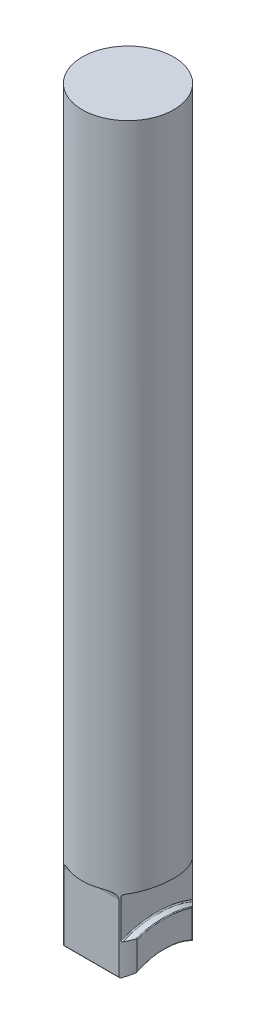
from build123d import *

# Parameters (mm, degrees)
SKETCH1_W               = 31.75
SKETCH1_H               = 276.225
BOSS_EXTRUDE1_DEPTH     = 15.875
CUT_EXTRUDE4_DEPTH      = 278.135854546
CUT_EXTRUDE4_DEPTH_BACK = 278.135854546
SKETCH8_R               = 22.225
SKETCH2_W               = 5.969
SKETCH2_H               = 13.462
CUT_EXTRUDE2_DEPTH      = 278.135854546
CUT_EXTRUDE2_DEPTH_BACK = 278.135854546
CUT_EXTRUDE3_DEPTH      = 278.135854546
CUT_EXTRUDE3_DEPTH_BACK = 278.135854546
SKETCH7_W               = 3.175
SKETCH7_H               = 31.75
FILLET1_R               = 0.762
FILLET2_R               = 0.381
FILLET3_R               = 0.254
SKETCH9_OUTSIDE_W       = 86.078
SKETCH9_OUTSIDE_H       = 86.078
SKETCH9_OUTSIDE_R       = 15.875
CUT_EXTRUDE5_DEPTH      = 259.735825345


with BuildPart() as part:
    # Sketch1 → Boss-Extrude1 (new, symmetric)
    with BuildSketch(Plane(origin=(0, 0, 0), x_dir=(0, 0, -1), z_dir=(1, 0, 0))):
        with Locations((0, 138.1125)):
            Rectangle(SKETCH1_W, SKETCH1_H)
    extrude(amount=BOSS_EXTRUDE1_DEPTH, both=True)

    # Sketch8 → Cut-Extrude4 (cut, two sides: drawn at the far end of the back side and taken through both)
    with BuildSketch(Plane(origin=(0, 0, 0), x_dir=(0, 0, -1), z_dir=(1, 0, 0)).offset(-CUT_EXTRUDE4_DEPTH_BACK)):
        Circle(SKETCH8_R)
    extrude(amount=CUT_EXTRUDE4_DEPTH + CUT_EXTRUDE4_DEPTH_BACK, mode=Mode.SUBTRACT)

    # Sketch2 → Cut-Revolve1 (revolve, cut)
    with BuildSketch(Plane.XY):
        with Locations((12.8905, 38.481)):
            Rectangle(SKETCH2_W, SKETCH2_H)
        with Locations((-12.8905, 38.481)):
            Rectangle(SKETCH2_W, SKETCH2_H)
    revolve(axis=Axis((-8.84822894, 0, 0), (1, 0, 0)), mode=Mode.SUBTRACT)

    # Sketch6 → Cut-Extrude2 (cut, two sides: drawn at the far end of the back side and taken through both)
    with BuildSketch(Plane(origin=(0, 0, 0), x_dir=(0, 0, -1), z_dir=(1, 0, 0)).offset(-CUT_EXTRUDE2_DEPTH_BACK)):
        with BuildLine():
            Line((12.7, 0), (31.75, 0))
            Line((31.75, 0), (31.75, 44.4246))
            Line((31.75, 44.4246), (15.0876, 44.4246))
            ThreePointArc((15.0876, 44.4246), (13.399311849, 43.725288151), (12.7, 42.037))
            Line((12.7, 42.037), (12.7, 0))
        make_face()
        with BuildLine():
            Line((-12.7, 0), (-31.75, 0))
            Line((-31.75, 0), (-31.75, 44.4246))
            Line((-31.75, 44.4246), (-15.0876, 44.4246))
            ThreePointArc((-15.0876, 44.4246), (-13.399311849, 43.725288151), (-12.7, 42.037))
            Line((-12.7, 42.037), (-12.7, 0))
        make_face()
    extrude(amount=CUT_EXTRUDE2_DEPTH + CUT_EXTRUDE2_DEPTH_BACK, mode=Mode.SUBTRACT)

    # Sketch7 → Cut-Extrude3 (cut, two sides: drawn at the far end of the back side and taken through both)
    with BuildSketch(Plane.XY.offset(-CUT_EXTRUDE3_DEPTH_BACK)):
        with Locations((-14.2875, 15.875)):
            Rectangle(SKETCH7_W, SKETCH7_H)
        with Locations((14.2875, 15.875)):
            Rectangle(SKETCH7_W, SKETCH7_H)
    extrude(amount=CUT_EXTRUDE3_DEPTH + CUT_EXTRUDE3_DEPTH_BACK, mode=Mode.SUBTRACT)

    # Fillet1
    fillet1_edges = [part.edges().sort_by_distance(p)[0] for p in [
        (9.906, 45.212, 0),
        (-9.906, 45.212, 0),
    ]]
    fillet(fillet1_edges, radius=FILLET1_R)

    # Fillet2
    fillet2_edges = [part.edges().sort_by_distance(p)[0] for p in [
        (9.906, 31.75, 0),
        (-9.906, 31.75, 0),
    ]]
    fillet(fillet2_edges, radius=FILLET2_R)

    # Fillet3
    fillet3_edges = [part.edges().sort_by_distance(p)[0] for p in [
        (0, 18.238986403, -12.7),
        (12.7, 23.669171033, -12.7),
        (-12.7, 23.669171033, -12.7),
        (0, 18.238986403, 12.7),
        (-12.7, 31.75, 0),
        (-12.7, 23.669171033, 12.7),
        (-12.7, 22.225, 0),
        (12.7, 31.75, 0),
        (12.7, 22.225, 0),
        (12.7, 23.669171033, 12.7),
    ]]
    fillet(fillet3_edges, radius=FILLET3_R)

    # Sketch9 outside → Cut-Extrude5 (cut, through all)
    with BuildSketch(Plane(origin=(0, 276.225, 0), x_dir=(1, 0, 0), z_dir=(0, 1, 0))):
        Rectangle(SKETCH9_OUTSIDE_W, SKETCH9_OUTSIDE_H)
        with Locations(Location((0, 0, 0), (0, 0, 270))):
            Circle(SKETCH9_OUTSIDE_R, mode=Mode.SUBTRACT)
    extrude(amount=-CUT_EXTRUDE5_DEPTH, mode=Mode.SUBTRACT)


solid = part.part
